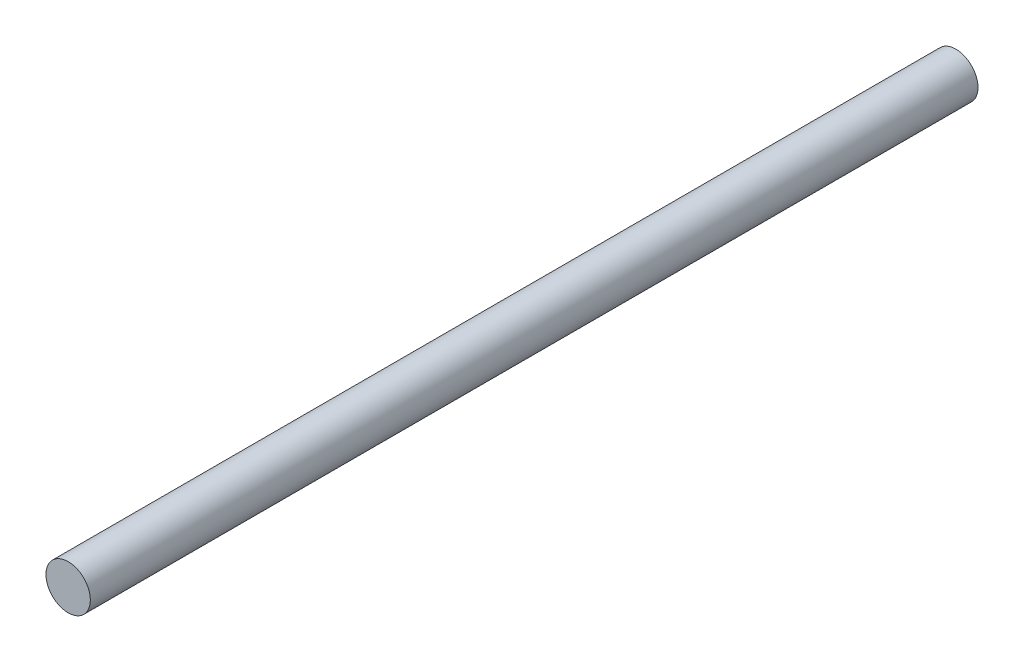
ISO-10303-21;
HEADER;
FILE_DESCRIPTION(('STEP AP214'),'2;1');
FILE_NAME('part.step','',(''),(''),'','','');
FILE_SCHEMA(('AUTOMOTIVE_DESIGN { 1 0 10303 214 1 1 1 1 }'));
ENDSEC;
DATA;
#1=APPLICATION_CONTEXT('core data for automotive mechanical design processes');
#2=APPLICATION_PROTOCOL_DEFINITION('international standard','automotive_design',2000,#1);
#3=PRODUCT_CONTEXT('',#1,'mechanical');
#4=PRODUCT('Part','Part','',(#3));
#5=PRODUCT_RELATED_PRODUCT_CATEGORY('part','',(#4));
#6=PRODUCT_DEFINITION_FORMATION('','',#4);
#7=PRODUCT_DEFINITION_CONTEXT('part definition',#1,'design');
#8=PRODUCT_DEFINITION('design','',#6,#7);
#9=PRODUCT_DEFINITION_SHAPE('','',#8);
#10=(LENGTH_UNIT() NAMED_UNIT(*) SI_UNIT(.MILLI.,.METRE.));
#11=(NAMED_UNIT(*) PLANE_ANGLE_UNIT() SI_UNIT($,.RADIAN.));
#12=(NAMED_UNIT(*) SI_UNIT($,.STERADIAN.) SOLID_ANGLE_UNIT());
#13=UNCERTAINTY_MEASURE_WITH_UNIT(LENGTH_MEASURE(1.E-05),#10,'distance_accuracy_value','');
#14=(GEOMETRIC_REPRESENTATION_CONTEXT(3) GLOBAL_UNCERTAINTY_ASSIGNED_CONTEXT((#13)) GLOBAL_UNIT_ASSIGNED_CONTEXT((#10,
#11,#12)) REPRESENTATION_CONTEXT('',''));
#15=CARTESIAN_POINT('',(0.,0.,0.));
#16=DIRECTION('',(0.,0.,1.));
#17=DIRECTION('',(1.,0.,0.));
#18=AXIS2_PLACEMENT_3D('',#15,#16,#17);
#19=CARTESIAN_POINT('',(-3.33066907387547E-13,0.,200.));
#20=DIRECTION('',(0.,0.,-1.));
#21=DIRECTION('',(-1.,0.,0.));
#22=AXIS2_PLACEMENT_3D('',#19,#20,#21);
#23=CYLINDRICAL_SURFACE('',#22,5.);
#24=CARTESIAN_POINT('',(-3.33066907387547E-13,0.,200.));
#25=DIRECTION('',(0.,0.,1.));
#26=DIRECTION('',(1.,0.,0.));
#27=AXIS2_PLACEMENT_3D('',#24,#25,#26);
#28=CIRCLE('',#27,5.);
#29=CARTESIAN_POINT('',(4.99999999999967,0.,200.));
#30=VERTEX_POINT('',#29);
#31=EDGE_CURVE('E13',#30,#30,#28,.T.);
#32=ORIENTED_EDGE('',*,*,#31,.F.);
#33=EDGE_LOOP('',(#32));
#34=FACE_BOUND('',#33,.T.);
#35=CARTESIAN_POINT('',(0.,0.,0.));
#36=DIRECTION('',(0.,0.,1.));
#37=DIRECTION('',(1.,0.,0.));
#38=AXIS2_PLACEMENT_3D('',#35,#36,#37);
#39=CIRCLE('',#38,5.);
#40=CARTESIAN_POINT('',(5.,0.,0.));
#41=VERTEX_POINT('',#40);
#42=EDGE_CURVE('E362',#41,#41,#39,.T.);
#43=ORIENTED_EDGE('',*,*,#42,.T.);
#44=EDGE_LOOP('',(#43));
#45=FACE_BOUND('',#44,.T.);
#46=ADVANCED_FACE('F356',(#34,#45),#23,.T.);
#47=CARTESIAN_POINT('',(-3.33066907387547E-13,0.,200.));
#48=DIRECTION('',(0.,0.,1.));
#49=DIRECTION('',(1.,0.,0.));
#50=AXIS2_PLACEMENT_3D('',#47,#48,#49);
#51=PLANE('',#50);
#52=ORIENTED_EDGE('',*,*,#31,.T.);
#53=EDGE_LOOP('',(#52));
#54=FACE_BOUND('',#53,.T.);
#55=ADVANCED_FACE('F384',(#54),#51,.T.);
#56=CARTESIAN_POINT('',(0.,0.,0.));
#57=DIRECTION('',(0.,0.,1.));
#58=DIRECTION('',(1.,0.,0.));
#59=AXIS2_PLACEMENT_3D('',#56,#57,#58);
#60=PLANE('',#59);
#61=CARTESIAN_POINT('',(0.,0.,0.));
#62=DIRECTION('',(0.,0.,-1.));
#63=DIRECTION('',(-1.,0.,0.));
#64=AXIS2_PLACEMENT_3D('',#61,#62,#63);
#65=CIRCLE('',#64,2.5);
#66=CARTESIAN_POINT('',(-2.5,0.,0.));
#67=VERTEX_POINT('',#66);
#68=EDGE_CURVE('E374',#67,#67,#65,.T.);
#69=ORIENTED_EDGE('',*,*,#68,.F.);
#70=EDGE_LOOP('',(#69));
#71=FACE_BOUND('',#70,.T.);
#72=ORIENTED_EDGE('',*,*,#42,.F.);
#73=EDGE_LOOP('',(#72));
#74=FACE_BOUND('',#73,.T.);
#75=ADVANCED_FACE('F382',(#71,#74),#60,.F.);
#76=CARTESIAN_POINT('',(0.,0.,0.));
#77=DIRECTION('',(0.,0.,-1.));
#78=DIRECTION('',(-1.,0.,0.));
#79=AXIS2_PLACEMENT_3D('',#76,#77,#78);
#80=CYLINDRICAL_SURFACE('',#79,2.5);
#81=CARTESIAN_POINT('',(0.,0.,16.9999999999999));
#82=DIRECTION('',(0.,0.,-1.));
#83=DIRECTION('',(-1.,0.,0.));
#84=AXIS2_PLACEMENT_3D('',#81,#82,#83);
#85=CIRCLE('',#84,2.5);
#86=CARTESIAN_POINT('',(-2.5,0.,16.9999999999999));
#87=VERTEX_POINT('',#86);
#88=EDGE_CURVE('E372',#87,#87,#85,.T.);
#89=ORIENTED_EDGE('',*,*,#88,.F.);
#90=EDGE_LOOP('',(#89));
#91=FACE_BOUND('',#90,.T.);
#92=ORIENTED_EDGE('',*,*,#68,.T.);
#93=EDGE_LOOP('',(#92));
#94=FACE_BOUND('',#93,.T.);
#95=ADVANCED_FACE('F368',(#91,#94),#80,.F.);
#96=CARTESIAN_POINT('',(0.,0.,16.9999999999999));
#97=DIRECTION('',(0.,0.,-1.));
#98=DIRECTION('',(-1.,0.,0.));
#99=AXIS2_PLACEMENT_3D('',#96,#97,#98);
#100=CONICAL_SURFACE('',#99,2.5,1.02974425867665);
#101=CARTESIAN_POINT('',(0.,0.,18.502151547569));
#102=VERTEX_POINT('',#101);
#103=VERTEX_LOOP('',#102);
#104=FACE_BOUND('',#103,.T.);
#105=ORIENTED_EDGE('',*,*,#88,.T.);
#106=EDGE_LOOP('',(#105));
#107=FACE_BOUND('',#106,.T.);
#108=ADVANCED_FACE('F365',(#104,#107),#100,.F.);
#109=CLOSED_SHELL('',(#46,#55,#75,#95,#108));
#110=MANIFOLD_SOLID_BREP('B2',#109);
#111=ADVANCED_BREP_SHAPE_REPRESENTATION('',(#18,#110),#14);
#112=SHAPE_DEFINITION_REPRESENTATION(#9,#111);
ENDSEC;
END-ISO-10303-21;
